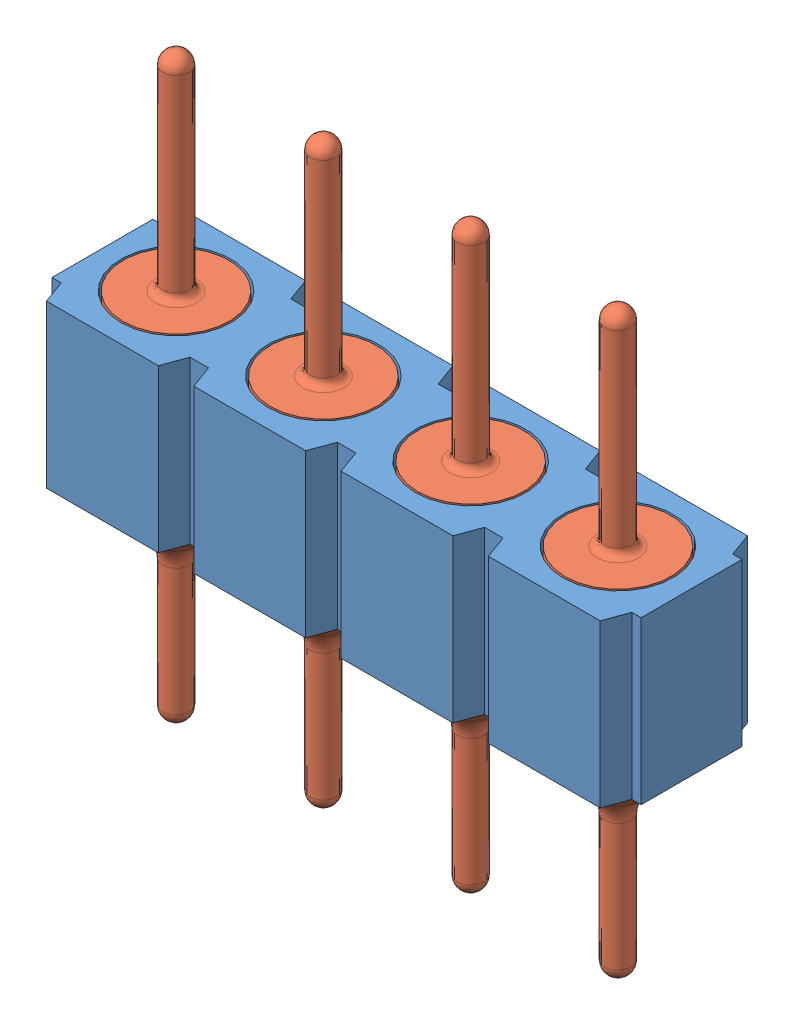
SolidWorks assembly 4 Pin Header.SLDASM, configuration Default (file format 7000). Lengths in mm.
Overall size (10.16 10.01 2.54).
5 component instances, 2 part files, 0 mates.
Components (placement in the parent):
- mill-max-350-40-104-00-006000_P3XX-11-010-00-000000(P304-11-010-00-000000)-1: mill-max-350-40-104-00-006000_P3XX-11-010-00-000000(P304-11-010-00-000000).sldprt [Default] at origin size (10.16 2.79 2.54)
- mill-max-350-40-104-00-006000_3404(3404-0-00-80-00-00-03-0)-1: mill-max-350-40-104-00-006000_3404(3404-0-00-80-00-00-03-0).sldprt [Default] at (6.0444 3.6068 -1.27) x (0 -1 0) z (0 0 1) size (10.01 1.83 1.83)
- mill-max-350-40-104-00-006000_3404(3404-0-00-80-00-00-03-0)-2: mill-max-350-40-104-00-006000_3404(3404-0-00-80-00-00-03-0).sldprt [Default] at (0.9644 3.6068 -1.27) x (0 -1 0) z (0 0 1) size (10.01 1.83 1.83)
- mill-max-350-40-104-00-006000_3404(3404-0-00-80-00-00-03-0)-3: mill-max-350-40-104-00-006000_3404(3404-0-00-80-00-00-03-0).sldprt [Default] at (3.5044 3.6068 -1.27) x (0 -1 0) z (0 0 1) size (10.01 1.83 1.83)
- mill-max-350-40-104-00-006000_3404(3404-0-00-80-00-00-03-0)-4: mill-max-350-40-104-00-006000_3404(3404-0-00-80-00-00-03-0).sldprt [Default] at (8.5844 3.6068 -1.27) x (0 -1 0) z (0 0 1) size (10.01 1.83 1.83)
